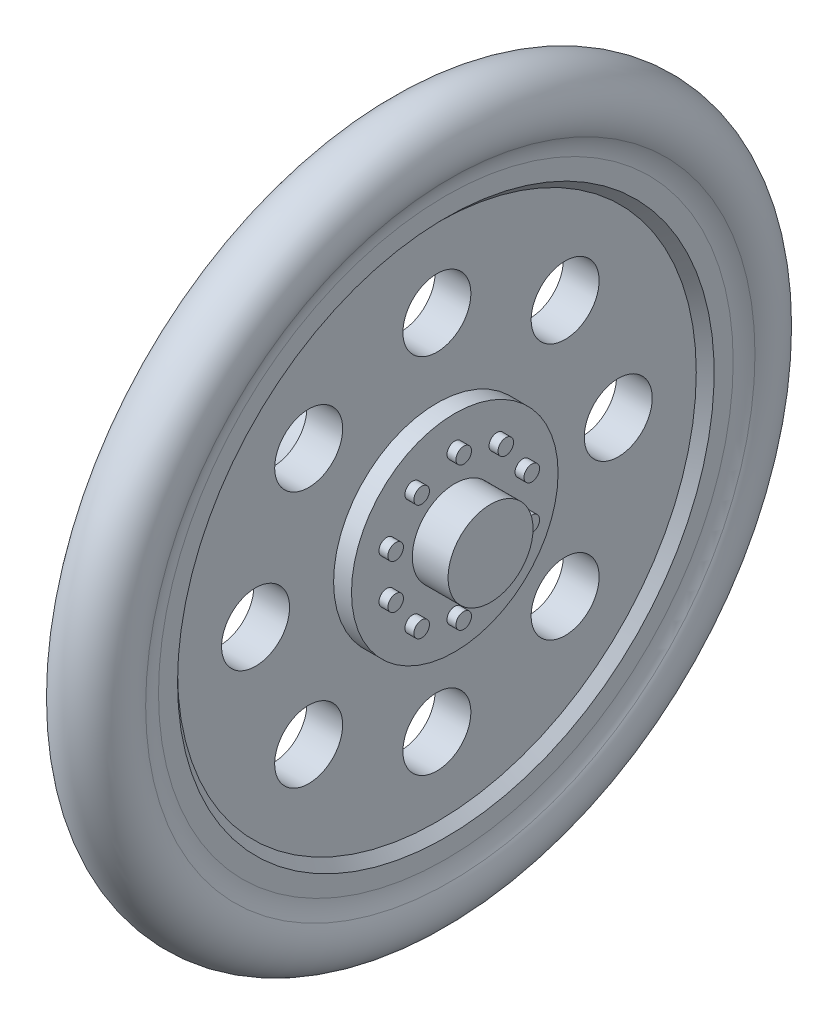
ISO-10303-21;
HEADER;
FILE_DESCRIPTION(('STEP AP214'),'2;1');
FILE_NAME('part.step','',(''),(''),'','','');
FILE_SCHEMA(('AUTOMOTIVE_DESIGN { 1 0 10303 214 1 1 1 1 }'));
ENDSEC;
DATA;
#1=APPLICATION_CONTEXT('core data for automotive mechanical design processes');
#2=APPLICATION_PROTOCOL_DEFINITION('international standard','automotive_design',2000,#1);
#3=PRODUCT_CONTEXT('',#1,'mechanical');
#4=PRODUCT('Part','Part','',(#3));
#5=PRODUCT_RELATED_PRODUCT_CATEGORY('part','',(#4));
#6=PRODUCT_DEFINITION_FORMATION('','',#4);
#7=PRODUCT_DEFINITION_CONTEXT('part definition',#1,'design');
#8=PRODUCT_DEFINITION('design','',#6,#7);
#9=PRODUCT_DEFINITION_SHAPE('','',#8);
#10=(LENGTH_UNIT() NAMED_UNIT(*) SI_UNIT(.MILLI.,.METRE.));
#11=(NAMED_UNIT(*) PLANE_ANGLE_UNIT() SI_UNIT($,.RADIAN.));
#12=(NAMED_UNIT(*) SI_UNIT($,.STERADIAN.) SOLID_ANGLE_UNIT());
#13=UNCERTAINTY_MEASURE_WITH_UNIT(LENGTH_MEASURE(1.E-05),#10,'distance_accuracy_value','');
#14=(GEOMETRIC_REPRESENTATION_CONTEXT(3) GLOBAL_UNCERTAINTY_ASSIGNED_CONTEXT((#13)) GLOBAL_UNIT_ASSIGNED_CONTEXT((#10,
#11,#12)) REPRESENTATION_CONTEXT('',''));
#15=CARTESIAN_POINT('',(0.,0.,0.));
#16=DIRECTION('',(0.,0.,1.));
#17=DIRECTION('',(1.,0.,0.));
#18=AXIS2_PLACEMENT_3D('',#15,#16,#17);
#19=CARTESIAN_POINT('',(10.5,0.,0.));
#20=DIRECTION('',(1.,0.,0.));
#21=DIRECTION('',(0.,0.,-1.));
#22=AXIS2_PLACEMENT_3D('',#19,#20,#21);
#23=PLANE('',#22);
#24=CARTESIAN_POINT('',(10.5,1.23606797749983,-3.8042260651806));
#25=DIRECTION('',(1.,0.,0.));
#26=DIRECTION('',(0.,-0.95105651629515,-0.309016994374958));
#27=AXIS2_PLACEMENT_3D('',#24,#25,#26);
#28=CIRCLE('',#27,0.435);
#29=CARTESIAN_POINT('',(10.5,0.822358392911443,-3.93864845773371));
#30=VERTEX_POINT('',#29);
#31=EDGE_CURVE('E102',#30,#30,#28,.T.);
#32=ORIENTED_EDGE('',*,*,#31,.F.);
#33=EDGE_LOOP('',(#32));
#34=FACE_BOUND('',#33,.T.);
#35=CARTESIAN_POINT('',(10.5,-3.23606797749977,-2.35114100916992));
#36=DIRECTION('',(1.,0.,0.));
#37=DIRECTION('',(0.,-0.58778525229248,0.809016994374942));
#38=AXIS2_PLACEMENT_3D('',#35,#36,#37);
#39=CIRCLE('',#38,0.435);
#40=CARTESIAN_POINT('',(10.5,-3.491754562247,-1.99921861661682));
#41=VERTEX_POINT('',#40);
#42=EDGE_CURVE('E114',#41,#41,#39,.T.);
#43=ORIENTED_EDGE('',*,*,#42,.F.);
#44=EDGE_LOOP('',(#43));
#45=FACE_BOUND('',#44,.T.);
#46=CARTESIAN_POINT('',(10.5,-3.2360679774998,2.35114100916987));
#47=DIRECTION('',(1.,0.,0.));
#48=DIRECTION('',(0.,0.587785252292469,0.809016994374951));
#49=AXIS2_PLACEMENT_3D('',#46,#47,#48);
#50=CIRCLE('',#49,0.435);
#51=CARTESIAN_POINT('',(10.5,-2.98038139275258,2.70306340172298));
#52=VERTEX_POINT('',#51);
#53=EDGE_CURVE('E126',#52,#52,#50,.T.);
#54=ORIENTED_EDGE('',*,*,#53,.F.);
#55=EDGE_LOOP('',(#54));
#56=FACE_BOUND('',#55,.T.);
#57=CARTESIAN_POINT('',(10.5,1.23606797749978,3.80422606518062));
#58=DIRECTION('',(1.,0.,0.));
#59=DIRECTION('',(0.,0.951056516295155,-0.309016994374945));
#60=AXIS2_PLACEMENT_3D('',#57,#58,#59);
#61=CIRCLE('',#60,0.435);
#62=CARTESIAN_POINT('',(10.5,1.64977756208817,3.66980367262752));
#63=VERTEX_POINT('',#62);
#64=EDGE_CURVE('E138',#63,#63,#61,.T.);
#65=ORIENTED_EDGE('',*,*,#64,.F.);
#66=EDGE_LOOP('',(#65));
#67=FACE_BOUND('',#66,.T.);
#68=CARTESIAN_POINT('',(10.5,4.,0.));
#69=DIRECTION('',(1.,0.,0.));
#70=DIRECTION('',(0.,0.,-1.));
#71=AXIS2_PLACEMENT_3D('',#68,#69,#70);
#72=CIRCLE('',#71,0.435);
#73=CARTESIAN_POINT('',(10.5,4.,-0.435));
#74=VERTEX_POINT('',#73);
#75=EDGE_CURVE('E150',#74,#74,#72,.T.);
#76=ORIENTED_EDGE('',*,*,#75,.F.);
#77=EDGE_LOOP('',(#76));
#78=FACE_BOUND('',#77,.T.);
#79=CARTESIAN_POINT('',(10.5,0.,0.));
#80=DIRECTION('',(1.,0.,0.));
#81=DIRECTION('',(0.,0.,-1.));
#82=AXIS2_PLACEMENT_3D('',#79,#80,#81);
#83=CIRCLE('',#82,5.775);
#84=CARTESIAN_POINT('',(10.5,0.,-5.775));
#85=VERTEX_POINT('',#84);
#86=EDGE_CURVE('E162',#85,#85,#83,.T.);
#87=ORIENTED_EDGE('',*,*,#86,.T.);
#88=EDGE_LOOP('',(#87));
#89=FACE_BOUND('',#88,.T.);
#90=CARTESIAN_POINT('',(10.5,0.,0.));
#91=DIRECTION('',(1.,0.,0.));
#92=DIRECTION('',(0.,0.,-1.));
#93=AXIS2_PLACEMENT_3D('',#90,#91,#92);
#94=CIRCLE('',#93,2.375);
#95=CARTESIAN_POINT('',(10.5,0.,-2.375));
#96=VERTEX_POINT('',#95);
#97=EDGE_CURVE('E156',#96,#96,#94,.T.);
#98=ORIENTED_EDGE('',*,*,#97,.F.);
#99=EDGE_LOOP('',(#98));
#100=FACE_BOUND('',#99,.T.);
#101=CARTESIAN_POINT('',(10.5,3.23606797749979,2.3511410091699));
#102=DIRECTION('',(1.,0.,0.));
#103=DIRECTION('',(0.,0.587785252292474,-0.809016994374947));
#104=AXIS2_PLACEMENT_3D('',#101,#102,#103);
#105=CIRCLE('',#104,0.435);
#106=CARTESIAN_POINT('',(10.5,3.49175456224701,1.9992186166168));
#107=VERTEX_POINT('',#106);
#108=EDGE_CURVE('E144',#107,#107,#105,.T.);
#109=ORIENTED_EDGE('',*,*,#108,.F.);
#110=EDGE_LOOP('',(#109));
#111=FACE_BOUND('',#110,.T.);
#112=CARTESIAN_POINT('',(10.5,-1.23606797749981,3.80422606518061));
#113=DIRECTION('',(1.,0.,0.));
#114=DIRECTION('',(0.,0.951056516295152,0.309016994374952));
#115=AXIS2_PLACEMENT_3D('',#112,#113,#114);
#116=CIRCLE('',#115,0.435);
#117=CARTESIAN_POINT('',(10.5,-0.822358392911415,3.93864845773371));
#118=VERTEX_POINT('',#117);
#119=EDGE_CURVE('E132',#118,#118,#116,.T.);
#120=ORIENTED_EDGE('',*,*,#119,.F.);
#121=EDGE_LOOP('',(#120));
#122=FACE_BOUND('',#121,.T.);
#123=CARTESIAN_POINT('',(10.5,-4.,0.));
#124=DIRECTION('',(1.,0.,0.));
#125=DIRECTION('',(0.,0.,1.));
#126=AXIS2_PLACEMENT_3D('',#123,#124,#125);
#127=CIRCLE('',#126,0.435);
#128=CARTESIAN_POINT('',(10.5,-4.,0.434999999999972));
#129=VERTEX_POINT('',#128);
#130=EDGE_CURVE('E120',#129,#129,#127,.T.);
#131=ORIENTED_EDGE('',*,*,#130,.F.);
#132=EDGE_LOOP('',(#131));
#133=FACE_BOUND('',#132,.T.);
#134=CARTESIAN_POINT('',(10.5,-1.23606797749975,-3.80422606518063));
#135=DIRECTION('',(1.,0.,0.));
#136=DIRECTION('',(0.,-0.951056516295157,0.309016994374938));
#137=AXIS2_PLACEMENT_3D('',#134,#135,#136);
#138=CIRCLE('',#137,0.435);
#139=CARTESIAN_POINT('',(10.5,-1.64977756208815,-3.66980367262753));
#140=VERTEX_POINT('',#139);
#141=EDGE_CURVE('E108',#140,#140,#138,.T.);
#142=ORIENTED_EDGE('',*,*,#141,.F.);
#143=EDGE_LOOP('',(#142));
#144=FACE_BOUND('',#143,.T.);
#145=CARTESIAN_POINT('',(10.5,3.23606797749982,-2.35114100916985));
#146=DIRECTION('',(1.,0.,0.));
#147=DIRECTION('',(0.,-0.587785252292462,-0.809016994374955));
#148=AXIS2_PLACEMENT_3D('',#145,#146,#147);
#149=CIRCLE('',#148,0.435);
#150=CARTESIAN_POINT('',(10.5,2.9803813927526,-2.70306340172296));
#151=VERTEX_POINT('',#150);
#152=EDGE_CURVE('E52',#151,#151,#149,.T.);
#153=ORIENTED_EDGE('',*,*,#152,.F.);
#154=EDGE_LOOP('',(#153));
#155=FACE_BOUND('',#154,.T.);
#156=ADVANCED_FACE('F32',(#34,#45,#56,#67,#78,#89,#100,#111,#122,#133,#144,#155),#23,.T.);
#157=CARTESIAN_POINT('',(9.5,14.5,0.));
#158=DIRECTION('',(-1.,0.,0.));
#159=DIRECTION('',(0.,0.,1.));
#160=AXIS2_PLACEMENT_3D('',#157,#158,#159);
#161=PLANE('',#160);
#162=CARTESIAN_POINT('',(9.5,7.16829499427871,-7.16829499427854));
#163=DIRECTION('',(1.,0.,0.));
#164=DIRECTION('',(0.,-0.707106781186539,-0.707106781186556));
#165=AXIS2_PLACEMENT_3D('',#162,#163,#164);
#166=CIRCLE('',#165,1.9);
#167=CARTESIAN_POINT('',(9.5,5.82479211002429,-8.511797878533));
#168=VERTEX_POINT('',#167);
#169=EDGE_CURVE('E85',#168,#168,#166,.T.);
#170=ORIENTED_EDGE('',*,*,#169,.F.);
#171=EDGE_LOOP('',(#170));
#172=FACE_BOUND('',#171,.T.);
#173=CARTESIAN_POINT('',(9.5,1.06184737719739E-13,-10.1375));
#174=DIRECTION('',(1.,0.,0.));
#175=DIRECTION('',(0.,-1.,0.));
#176=AXIS2_PLACEMENT_3D('',#173,#174,#175);
#177=CIRCLE('',#176,1.9);
#178=CARTESIAN_POINT('',(9.5,-1.8999999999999,-10.1375));
#179=VERTEX_POINT('',#178);
#180=EDGE_CURVE('E75',#179,#179,#177,.T.);
#181=ORIENTED_EDGE('',*,*,#180,.F.);
#182=EDGE_LOOP('',(#181));
#183=FACE_BOUND('',#182,.T.);
#184=CARTESIAN_POINT('',(9.5,-7.16829499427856,-7.16829499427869));
#185=DIRECTION('',(1.,0.,0.));
#186=DIRECTION('',(0.,-0.707106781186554,0.707106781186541));
#187=AXIS2_PLACEMENT_3D('',#184,#185,#186);
#188=CIRCLE('',#187,1.9);
#189=CARTESIAN_POINT('',(9.5,-8.51179787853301,-5.82479211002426));
#190=VERTEX_POINT('',#189);
#191=EDGE_CURVE('E72',#190,#190,#188,.T.);
#192=ORIENTED_EDGE('',*,*,#191,.F.);
#193=EDGE_LOOP('',(#192));
#194=FACE_BOUND('',#193,.T.);
#195=CARTESIAN_POINT('',(9.5,-10.1375,0.));
#196=DIRECTION('',(1.,0.,0.));
#197=DIRECTION('',(0.,0.,1.));
#198=AXIS2_PLACEMENT_3D('',#195,#196,#197);
#199=CIRCLE('',#198,1.9);
#200=CARTESIAN_POINT('',(9.5,-10.1375,1.89999999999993));
#201=VERTEX_POINT('',#200);
#202=EDGE_CURVE('E69',#201,#201,#199,.T.);
#203=ORIENTED_EDGE('',*,*,#202,.F.);
#204=EDGE_LOOP('',(#203));
#205=FACE_BOUND('',#204,.T.);
#206=CARTESIAN_POINT('',(9.5,-7.16829499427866,7.16829499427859));
#207=DIRECTION('',(1.,0.,0.));
#208=DIRECTION('',(0.,0.707106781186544,0.707106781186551));
#209=AXIS2_PLACEMENT_3D('',#206,#207,#208);
#210=CIRCLE('',#209,1.9);
#211=CARTESIAN_POINT('',(9.5,-5.82479211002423,8.51179787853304));
#212=VERTEX_POINT('',#211);
#213=EDGE_CURVE('E65',#212,#212,#210,.T.);
#214=ORIENTED_EDGE('',*,*,#213,.F.);
#215=EDGE_LOOP('',(#214));
#216=FACE_BOUND('',#215,.T.);
#217=CARTESIAN_POINT('',(9.5,0.,10.1375));
#218=DIRECTION('',(1.,0.,0.));
#219=DIRECTION('',(0.,1.,0.));
#220=AXIS2_PLACEMENT_3D('',#217,#218,#219);
#221=CIRCLE('',#220,1.9);
#222=CARTESIAN_POINT('',(9.5,1.89999999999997,10.1375));
#223=VERTEX_POINT('',#222);
#224=EDGE_CURVE('E61',#223,#223,#221,.T.);
#225=ORIENTED_EDGE('',*,*,#224,.F.);
#226=EDGE_LOOP('',(#225));
#227=FACE_BOUND('',#226,.T.);
#228=CARTESIAN_POINT('',(9.5,7.16829499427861,7.16829499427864));
#229=DIRECTION('',(1.,0.,0.));
#230=DIRECTION('',(0.,0.707106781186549,-0.707106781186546));
#231=AXIS2_PLACEMENT_3D('',#228,#229,#230);
#232=CIRCLE('',#231,1.9);
#233=CARTESIAN_POINT('',(9.5,8.51179787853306,5.8247921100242));
#234=VERTEX_POINT('',#233);
#235=EDGE_CURVE('E57',#234,#234,#232,.T.);
#236=ORIENTED_EDGE('',*,*,#235,.F.);
#237=EDGE_LOOP('',(#236));
#238=FACE_BOUND('',#237,.T.);
#239=CARTESIAN_POINT('',(9.5,10.1375,0.));
#240=DIRECTION('',(1.,0.,0.));
#241=DIRECTION('',(0.,0.,-1.));
#242=AXIS2_PLACEMENT_3D('',#239,#240,#241);
#243=CIRCLE('',#242,1.9);
#244=CARTESIAN_POINT('',(9.5,10.1375,-1.9));
#245=VERTEX_POINT('',#244);
#246=EDGE_CURVE('E53',#245,#245,#243,.T.);
#247=ORIENTED_EDGE('',*,*,#246,.F.);
#248=EDGE_LOOP('',(#247));
#249=FACE_BOUND('',#248,.T.);
#250=CARTESIAN_POINT('',(9.5,0.,0.));
#251=DIRECTION('',(-1.,0.,0.));
#252=DIRECTION('',(0.,0.,1.));
#253=AXIS2_PLACEMENT_3D('',#250,#251,#252);
#254=CIRCLE('',#253,14.5);
#255=CARTESIAN_POINT('',(9.5,0.,14.5));
#256=VERTEX_POINT('',#255);
#257=EDGE_CURVE('E182',#256,#256,#254,.T.);
#258=ORIENTED_EDGE('',*,*,#257,.F.);
#259=EDGE_LOOP('',(#258));
#260=FACE_BOUND('',#259,.T.);
#261=CARTESIAN_POINT('',(9.5,0.,0.));
#262=DIRECTION('',(-1.,0.,0.));
#263=DIRECTION('',(0.,0.,1.));
#264=AXIS2_PLACEMENT_3D('',#261,#262,#263);
#265=CIRCLE('',#264,5.775);
#266=CARTESIAN_POINT('',(9.5,0.,5.775));
#267=VERTEX_POINT('',#266);
#268=EDGE_CURVE('E11',#267,#267,#265,.F.);
#269=ORIENTED_EDGE('',*,*,#268,.F.);
#270=EDGE_LOOP('',(#269));
#271=FACE_BOUND('',#270,.T.);
#272=ADVANCED_FACE('F220',(#172,#183,#194,#205,#216,#227,#238,#249,#260,#271),#161,.F.);
#273=CARTESIAN_POINT('',(0.,0.,0.));
#274=DIRECTION('',(1.,0.,0.));
#275=DIRECTION('',(0.,0.,-1.));
#276=AXIS2_PLACEMENT_3D('',#273,#274,#275);
#277=PLANE('',#276);
#278=CARTESIAN_POINT('',(0.,0.,0.));
#279=DIRECTION('',(-1.,0.,0.));
#280=DIRECTION('',(0.,0.,1.));
#281=AXIS2_PLACEMENT_3D('',#278,#279,#280);
#282=CIRCLE('',#281,1.63);
#283=CARTESIAN_POINT('',(0.,0.,1.63));
#284=VERTEX_POINT('',#283);
#285=EDGE_CURVE('E638',#284,#284,#282,.T.);
#286=ORIENTED_EDGE('',*,*,#285,.F.);
#287=EDGE_LOOP('',(#286));
#288=FACE_BOUND('',#287,.T.);
#289=CARTESIAN_POINT('',(0.,0.,0.));
#290=DIRECTION('',(-1.,0.,0.));
#291=DIRECTION('',(0.,0.,1.));
#292=AXIS2_PLACEMENT_3D('',#289,#290,#291);
#293=CIRCLE('',#292,3.1);
#294=CARTESIAN_POINT('',(0.,0.,3.1));
#295=VERTEX_POINT('',#294);
#296=EDGE_CURVE('E167',#295,#295,#293,.T.);
#297=ORIENTED_EDGE('',*,*,#296,.T.);
#298=EDGE_LOOP('',(#297));
#299=FACE_BOUND('',#298,.T.);
#300=ADVANCED_FACE('F226',(#288,#299),#277,.F.);
#301=CARTESIAN_POINT('',(9.5,0.,0.));
#302=DIRECTION('',(1.,0.,0.));
#303=DIRECTION('',(0.,0.,-1.));
#304=AXIS2_PLACEMENT_3D('',#301,#302,#303);
#305=CONICAL_SURFACE('',#304,14.5,0.785398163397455);
#306=CARTESIAN_POINT('',(10.,0.,0.));
#307=DIRECTION('',(-1.,0.,0.));
#308=DIRECTION('',(0.,0.,1.));
#309=AXIS2_PLACEMENT_3D('',#306,#307,#308);
#310=CIRCLE('',#309,15.);
#311=CARTESIAN_POINT('',(10.,0.,15.));
#312=VERTEX_POINT('',#311);
#313=EDGE_CURVE('E179',#312,#312,#310,.T.);
#314=ORIENTED_EDGE('',*,*,#313,.F.);
#315=EDGE_LOOP('',(#314));
#316=FACE_BOUND('',#315,.T.);
#317=ORIENTED_EDGE('',*,*,#257,.T.);
#318=EDGE_LOOP('',(#317));
#319=FACE_BOUND('',#318,.T.);
#320=ADVANCED_FACE('F250',(#316,#319),#305,.F.);
#321=CARTESIAN_POINT('',(10.,16.6771243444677,0.));
#322=DIRECTION('',(-1.,0.,0.));
#323=DIRECTION('',(0.,0.,1.));
#324=AXIS2_PLACEMENT_3D('',#321,#322,#323);
#325=PLANE('',#324);
#326=CARTESIAN_POINT('',(10.,0.,0.));
#327=DIRECTION('',(-1.,0.,0.));
#328=DIRECTION('',(0.,0.,1.));
#329=AXIS2_PLACEMENT_3D('',#326,#327,#328);
#330=CIRCLE('',#329,16.0635083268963);
#331=CARTESIAN_POINT('',(10.,0.,16.0635083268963));
#332=VERTEX_POINT('',#331);
#333=EDGE_CURVE('E40',#332,#332,#330,.F.);
#334=ORIENTED_EDGE('',*,*,#333,.T.);
#335=EDGE_LOOP('',(#334));
#336=FACE_BOUND('',#335,.T.);
#337=ORIENTED_EDGE('',*,*,#313,.T.);
#338=EDGE_LOOP('',(#337));
#339=FACE_BOUND('',#338,.T.);
#340=ADVANCED_FACE('F256',(#336,#339),#325,.F.);
#341=CARTESIAN_POINT('',(8.5,0.,0.));
#342=DIRECTION('',(-1.,0.,0.));
#343=DIRECTION('',(0.,0.,1.));
#344=AXIS2_PLACEMENT_3D('',#341,#342,#343);
#345=TOROIDAL_SURFACE('',#344,18.,2.);
#346=CARTESIAN_POINT('',(6.75000000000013,0.,0.));
#347=DIRECTION('',(1.,0.,0.));
#348=DIRECTION('',(0.,0.,-1.));
#349=AXIS2_PLACEMENT_3D('',#346,#347,#348);
#350=CIRCLE('',#349,17.0317541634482);
#351=CARTESIAN_POINT('',(6.75000000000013,0.,-17.0317541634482));
#352=VERTEX_POINT('',#351);
#353=EDGE_CURVE('E45',#352,#352,#350,.T.);
#354=ORIENTED_EDGE('',*,*,#353,.T.);
#355=EDGE_LOOP('',(#354));
#356=FACE_BOUND('',#355,.T.);
#357=CARTESIAN_POINT('',(10.2499999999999,0.,0.));
#358=DIRECTION('',(-1.,0.,0.));
#359=DIRECTION('',(0.,0.,1.));
#360=AXIS2_PLACEMENT_3D('',#357,#358,#359);
#361=CIRCLE('',#360,17.0317541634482);
#362=CARTESIAN_POINT('',(10.2499999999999,0.,17.0317541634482));
#363=VERTEX_POINT('',#362);
#364=EDGE_CURVE('E188',#363,#363,#361,.T.);
#365=ORIENTED_EDGE('',*,*,#364,.T.);
#366=EDGE_LOOP('',(#365));
#367=FACE_BOUND('',#366,.T.);
#368=ADVANCED_FACE('F193',(#356,#367),#345,.T.);
#369=CARTESIAN_POINT('',(7.,16.6771243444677,0.));
#370=DIRECTION('',(1.,0.,0.));
#371=DIRECTION('',(0.,0.,-1.));
#372=AXIS2_PLACEMENT_3D('',#369,#370,#371);
#373=PLANE('',#372);
#374=CARTESIAN_POINT('',(7.,0.,0.));
#375=DIRECTION('',(1.,0.,0.));
#376=DIRECTION('',(0.,0.,-1.));
#377=AXIS2_PLACEMENT_3D('',#374,#375,#376);
#378=CIRCLE('',#377,16.0635083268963);
#379=CARTESIAN_POINT('',(7.,0.,-16.0635083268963));
#380=VERTEX_POINT('',#379);
#381=EDGE_CURVE('E185',#380,#380,#378,.F.);
#382=ORIENTED_EDGE('',*,*,#381,.T.);
#383=EDGE_LOOP('',(#382));
#384=FACE_BOUND('',#383,.T.);
#385=CARTESIAN_POINT('',(7.,0.,0.));
#386=DIRECTION('',(-1.,0.,0.));
#387=DIRECTION('',(0.,0.,1.));
#388=AXIS2_PLACEMENT_3D('',#385,#386,#387);
#389=CIRCLE('',#388,15.);
#390=CARTESIAN_POINT('',(7.,0.,15.));
#391=VERTEX_POINT('',#390);
#392=EDGE_CURVE('E176',#391,#391,#389,.T.);
#393=ORIENTED_EDGE('',*,*,#392,.F.);
#394=EDGE_LOOP('',(#393));
#395=FACE_BOUND('',#394,.T.);
#396=ADVANCED_FACE('F202',(#384,#395),#373,.F.);
#397=CARTESIAN_POINT('',(7.,0.,0.));
#398=DIRECTION('',(-1.,0.,0.));
#399=DIRECTION('',(0.,0.,1.));
#400=AXIS2_PLACEMENT_3D('',#397,#398,#399);
#401=CONICAL_SURFACE('',#400,15.,0.785398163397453);
#402=CARTESIAN_POINT('',(7.5,0.,0.));
#403=DIRECTION('',(-1.,0.,0.));
#404=DIRECTION('',(0.,0.,1.));
#405=AXIS2_PLACEMENT_3D('',#402,#403,#404);
#406=CIRCLE('',#405,14.5);
#407=CARTESIAN_POINT('',(7.5,0.,14.5));
#408=VERTEX_POINT('',#407);
#409=EDGE_CURVE('E173',#408,#408,#406,.T.);
#410=ORIENTED_EDGE('',*,*,#409,.F.);
#411=EDGE_LOOP('',(#410));
#412=FACE_BOUND('',#411,.T.);
#413=ORIENTED_EDGE('',*,*,#392,.T.);
#414=EDGE_LOOP('',(#413));
#415=FACE_BOUND('',#414,.T.);
#416=ADVANCED_FACE('F205',(#412,#415),#401,.F.);
#417=CARTESIAN_POINT('',(7.5,3.1,0.));
#418=DIRECTION('',(1.,0.,0.));
#419=DIRECTION('',(0.,0.,-1.));
#420=AXIS2_PLACEMENT_3D('',#417,#418,#419);
#421=PLANE('',#420);
#422=CARTESIAN_POINT('',(7.5,7.16829499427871,-7.16829499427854));
#423=DIRECTION('',(1.,0.,0.));
#424=DIRECTION('',(0.,0.,-1.));
#425=AXIS2_PLACEMENT_3D('',#422,#423,#424);
#426=CIRCLE('',#425,1.9);
#427=CARTESIAN_POINT('',(7.5,7.16829499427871,-9.06829499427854));
#428=VERTEX_POINT('',#427);
#429=EDGE_CURVE('E36',#428,#428,#426,.T.);
#430=ORIENTED_EDGE('',*,*,#429,.T.);
#431=EDGE_LOOP('',(#430));
#432=FACE_BOUND('',#431,.T.);
#433=CARTESIAN_POINT('',(7.5,1.06184737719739E-13,-10.1375));
#434=DIRECTION('',(1.,0.,0.));
#435=DIRECTION('',(0.,0.,-1.));
#436=AXIS2_PLACEMENT_3D('',#433,#434,#435);
#437=CIRCLE('',#436,1.9);
#438=CARTESIAN_POINT('',(7.5,1.06184737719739E-13,-12.0375));
#439=VERTEX_POINT('',#438);
#440=EDGE_CURVE('E73',#439,#439,#437,.T.);
#441=ORIENTED_EDGE('',*,*,#440,.T.);
#442=EDGE_LOOP('',(#441));
#443=FACE_BOUND('',#442,.T.);
#444=CARTESIAN_POINT('',(7.5,-7.16829499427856,-7.16829499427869));
#445=DIRECTION('',(1.,0.,0.));
#446=DIRECTION('',(0.,0.,-1.));
#447=AXIS2_PLACEMENT_3D('',#444,#445,#446);
#448=CIRCLE('',#447,1.9);
#449=CARTESIAN_POINT('',(7.5,-7.16829499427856,-9.06829499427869));
#450=VERTEX_POINT('',#449);
#451=EDGE_CURVE('E70',#450,#450,#448,.T.);
#452=ORIENTED_EDGE('',*,*,#451,.T.);
#453=EDGE_LOOP('',(#452));
#454=FACE_BOUND('',#453,.T.);
#455=CARTESIAN_POINT('',(7.5,-10.1375,0.));
#456=DIRECTION('',(1.,0.,0.));
#457=DIRECTION('',(0.,0.,-1.));
#458=AXIS2_PLACEMENT_3D('',#455,#456,#457);
#459=CIRCLE('',#458,1.9);
#460=CARTESIAN_POINT('',(7.5,-10.1375,-1.90000000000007));
#461=VERTEX_POINT('',#460);
#462=EDGE_CURVE('E66',#461,#461,#459,.T.);
#463=ORIENTED_EDGE('',*,*,#462,.T.);
#464=EDGE_LOOP('',(#463));
#465=FACE_BOUND('',#464,.T.);
#466=CARTESIAN_POINT('',(7.5,-7.16829499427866,7.16829499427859));
#467=DIRECTION('',(1.,0.,0.));
#468=DIRECTION('',(0.,0.,-1.));
#469=AXIS2_PLACEMENT_3D('',#466,#467,#468);
#470=CIRCLE('',#469,1.9);
#471=CARTESIAN_POINT('',(7.5,-7.16829499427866,5.26829499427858));
#472=VERTEX_POINT('',#471);
#473=EDGE_CURVE('E62',#472,#472,#470,.T.);
#474=ORIENTED_EDGE('',*,*,#473,.T.);
#475=EDGE_LOOP('',(#474));
#476=FACE_BOUND('',#475,.T.);
#477=CARTESIAN_POINT('',(7.5,0.,10.1375));
#478=DIRECTION('',(1.,0.,0.));
#479=DIRECTION('',(0.,0.,-1.));
#480=AXIS2_PLACEMENT_3D('',#477,#478,#479);
#481=CIRCLE('',#480,1.9);
#482=CARTESIAN_POINT('',(7.5,0.,8.2375));
#483=VERTEX_POINT('',#482);
#484=EDGE_CURVE('E58',#483,#483,#481,.T.);
#485=ORIENTED_EDGE('',*,*,#484,.T.);
#486=EDGE_LOOP('',(#485));
#487=FACE_BOUND('',#486,.T.);
#488=CARTESIAN_POINT('',(7.5,7.16829499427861,7.16829499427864));
#489=DIRECTION('',(1.,0.,0.));
#490=DIRECTION('',(0.,0.,-1.));
#491=AXIS2_PLACEMENT_3D('',#488,#489,#490);
#492=CIRCLE('',#491,1.9);
#493=CARTESIAN_POINT('',(7.5,7.16829499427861,5.26829499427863));
#494=VERTEX_POINT('',#493);
#495=EDGE_CURVE('E54',#494,#494,#492,.T.);
#496=ORIENTED_EDGE('',*,*,#495,.T.);
#497=EDGE_LOOP('',(#496));
#498=FACE_BOUND('',#497,.T.);
#499=CARTESIAN_POINT('',(7.5,10.1375,0.));
#500=DIRECTION('',(1.,0.,0.));
#501=DIRECTION('',(0.,0.,-1.));
#502=AXIS2_PLACEMENT_3D('',#499,#500,#501);
#503=CIRCLE('',#502,1.9);
#504=CARTESIAN_POINT('',(7.5,10.1375,-1.9));
#505=VERTEX_POINT('',#504);
#506=EDGE_CURVE('E49',#505,#505,#503,.T.);
#507=ORIENTED_EDGE('',*,*,#506,.T.);
#508=EDGE_LOOP('',(#507));
#509=FACE_BOUND('',#508,.T.);
#510=CARTESIAN_POINT('',(7.5,0.,0.));
#511=DIRECTION('',(-1.,0.,0.));
#512=DIRECTION('',(0.,0.,1.));
#513=AXIS2_PLACEMENT_3D('',#510,#511,#512);
#514=CIRCLE('',#513,3.1);
#515=CARTESIAN_POINT('',(7.5,0.,3.1));
#516=VERTEX_POINT('',#515);
#517=EDGE_CURVE('E170',#516,#516,#514,.T.);
#518=ORIENTED_EDGE('',*,*,#517,.F.);
#519=EDGE_LOOP('',(#518));
#520=FACE_BOUND('',#519,.T.);
#521=ORIENTED_EDGE('',*,*,#409,.T.);
#522=EDGE_LOOP('',(#521));
#523=FACE_BOUND('',#522,.T.);
#524=ADVANCED_FACE('F210',(#432,#443,#454,#465,#476,#487,#498,#509,#520,#523),#421,.F.);
#525=CARTESIAN_POINT('',(0.,0.,0.));
#526=DIRECTION('',(-1.,0.,0.));
#527=DIRECTION('',(0.,0.,1.));
#528=AXIS2_PLACEMENT_3D('',#525,#526,#527);
#529=CYLINDRICAL_SURFACE('',#528,3.1);
#530=ORIENTED_EDGE('',*,*,#296,.F.);
#531=EDGE_LOOP('',(#530));
#532=FACE_BOUND('',#531,.T.);
#533=ORIENTED_EDGE('',*,*,#517,.T.);
#534=EDGE_LOOP('',(#533));
#535=FACE_BOUND('',#534,.T.);
#536=ADVANCED_FACE('F199',(#532,#535),#529,.T.);
#537=CARTESIAN_POINT('',(5.,0.,0.));
#538=DIRECTION('',(-1.,0.,0.));
#539=DIRECTION('',(0.,0.,1.));
#540=AXIS2_PLACEMENT_3D('',#537,#538,#539);
#541=TOROIDAL_SURFACE('',#540,16.0635083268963,2.);
#542=ORIENTED_EDGE('',*,*,#353,.F.);
#543=EDGE_LOOP('',(#542));
#544=FACE_BOUND('',#543,.T.);
#545=ORIENTED_EDGE('',*,*,#381,.F.);
#546=EDGE_LOOP('',(#545));
#547=FACE_BOUND('',#546,.T.);
#548=ADVANCED_FACE('F196',(#544,#547),#541,.F.);
#549=CARTESIAN_POINT('',(12.,0.,0.));
#550=DIRECTION('',(1.,0.,0.));
#551=DIRECTION('',(0.,0.,-1.));
#552=AXIS2_PLACEMENT_3D('',#549,#550,#551);
#553=TOROIDAL_SURFACE('',#552,16.0635083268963,2.);
#554=ORIENTED_EDGE('',*,*,#333,.F.);
#555=EDGE_LOOP('',(#554));
#556=FACE_BOUND('',#555,.T.);
#557=ORIENTED_EDGE('',*,*,#364,.F.);
#558=EDGE_LOOP('',(#557));
#559=FACE_BOUND('',#558,.T.);
#560=ADVANCED_FACE('F34',(#556,#559),#553,.F.);
#561=CARTESIAN_POINT('',(10.5,0.,0.));
#562=DIRECTION('',(-1.,0.,0.));
#563=DIRECTION('',(0.,0.,1.));
#564=AXIS2_PLACEMENT_3D('',#561,#562,#563);
#565=CYLINDRICAL_SURFACE('',#564,5.775);
#566=ORIENTED_EDGE('',*,*,#86,.F.);
#567=EDGE_LOOP('',(#566));
#568=FACE_BOUND('',#567,.T.);
#569=ORIENTED_EDGE('',*,*,#268,.T.);
#570=EDGE_LOOP('',(#569));
#571=FACE_BOUND('',#570,.T.);
#572=ADVANCED_FACE('F235',(#568,#571),#565,.T.);
#573=CARTESIAN_POINT('',(12.5,0.,0.));
#574=DIRECTION('',(-1.,0.,0.));
#575=DIRECTION('',(0.,0.,1.));
#576=AXIS2_PLACEMENT_3D('',#573,#574,#575);
#577=CYLINDRICAL_SURFACE('',#576,2.375);
#578=CARTESIAN_POINT('',(12.5,0.,0.));
#579=DIRECTION('',(1.,0.,0.));
#580=DIRECTION('',(0.,0.,-1.));
#581=AXIS2_PLACEMENT_3D('',#578,#579,#580);
#582=CIRCLE('',#581,2.375);
#583=CARTESIAN_POINT('',(12.5,0.,-2.375));
#584=VERTEX_POINT('',#583);
#585=EDGE_CURVE('E159',#584,#584,#582,.T.);
#586=ORIENTED_EDGE('',*,*,#585,.F.);
#587=EDGE_LOOP('',(#586));
#588=FACE_BOUND('',#587,.T.);
#589=ORIENTED_EDGE('',*,*,#97,.T.);
#590=EDGE_LOOP('',(#589));
#591=FACE_BOUND('',#590,.T.);
#592=ADVANCED_FACE('F233',(#588,#591),#577,.T.);
#593=CARTESIAN_POINT('',(12.5,0.,0.));
#594=DIRECTION('',(1.,0.,0.));
#595=DIRECTION('',(0.,0.,-1.));
#596=AXIS2_PLACEMENT_3D('',#593,#594,#595);
#597=PLANE('',#596);
#598=ORIENTED_EDGE('',*,*,#585,.T.);
#599=EDGE_LOOP('',(#598));
#600=FACE_BOUND('',#599,.T.);
#601=ADVANCED_FACE('F305',(#600),#597,.T.);
#602=CARTESIAN_POINT('',(11.,4.,0.));
#603=DIRECTION('',(-1.,0.,0.));
#604=DIRECTION('',(0.,0.,1.));
#605=AXIS2_PLACEMENT_3D('',#602,#603,#604);
#606=CYLINDRICAL_SURFACE('',#605,0.435);
#607=CARTESIAN_POINT('',(11.,4.,0.));
#608=DIRECTION('',(1.,0.,0.));
#609=DIRECTION('',(0.,0.,-1.));
#610=AXIS2_PLACEMENT_3D('',#607,#608,#609);
#611=CIRCLE('',#610,0.435);
#612=CARTESIAN_POINT('',(11.,4.,-0.435));
#613=VERTEX_POINT('',#612);
#614=EDGE_CURVE('E153',#613,#613,#611,.T.);
#615=ORIENTED_EDGE('',*,*,#614,.F.);
#616=EDGE_LOOP('',(#615));
#617=FACE_BOUND('',#616,.T.);
#618=ORIENTED_EDGE('',*,*,#75,.T.);
#619=EDGE_LOOP('',(#618));
#620=FACE_BOUND('',#619,.T.);
#621=ADVANCED_FACE('F314',(#617,#620),#606,.T.);
#622=CARTESIAN_POINT('',(11.,4.,0.));
#623=DIRECTION('',(1.,0.,0.));
#624=DIRECTION('',(0.,0.,-1.));
#625=AXIS2_PLACEMENT_3D('',#622,#623,#624);
#626=PLANE('',#625);
#627=ORIENTED_EDGE('',*,*,#614,.T.);
#628=EDGE_LOOP('',(#627));
#629=FACE_BOUND('',#628,.T.);
#630=ADVANCED_FACE('F323',(#629),#626,.T.);
#631=CARTESIAN_POINT('',(11.,3.23606797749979,2.3511410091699));
#632=DIRECTION('',(-1.,0.,0.));
#633=DIRECTION('',(0.,0.,1.));
#634=AXIS2_PLACEMENT_3D('',#631,#632,#633);
#635=CYLINDRICAL_SURFACE('',#634,0.435);
#636=CARTESIAN_POINT('',(11.,3.23606797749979,2.3511410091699));
#637=DIRECTION('',(1.,0.,0.));
#638=DIRECTION('',(0.,0.587785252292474,-0.809016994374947));
#639=AXIS2_PLACEMENT_3D('',#636,#637,#638);
#640=CIRCLE('',#639,0.435);
#641=CARTESIAN_POINT('',(11.,3.49175456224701,1.9992186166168));
#642=VERTEX_POINT('',#641);
#643=EDGE_CURVE('E147',#642,#642,#640,.T.);
#644=ORIENTED_EDGE('',*,*,#643,.F.);
#645=EDGE_LOOP('',(#644));
#646=FACE_BOUND('',#645,.T.);
#647=ORIENTED_EDGE('',*,*,#108,.T.);
#648=EDGE_LOOP('',(#647));
#649=FACE_BOUND('',#648,.T.);
#650=ADVANCED_FACE('F332',(#646,#649),#635,.T.);
#651=CARTESIAN_POINT('',(11.,3.23606797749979,2.3511410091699));
#652=DIRECTION('',(1.,0.,0.));
#653=DIRECTION('',(0.,0.587785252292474,-0.809016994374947));
#654=AXIS2_PLACEMENT_3D('',#651,#652,#653);
#655=PLANE('',#654);
#656=ORIENTED_EDGE('',*,*,#643,.T.);
#657=EDGE_LOOP('',(#656));
#658=FACE_BOUND('',#657,.T.);
#659=ADVANCED_FACE('F347',(#658),#655,.T.);
#660=CARTESIAN_POINT('',(11.,1.23606797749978,3.80422606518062));
#661=DIRECTION('',(-1.,0.,0.));
#662=DIRECTION('',(0.,0.,1.));
#663=AXIS2_PLACEMENT_3D('',#660,#661,#662);
#664=CYLINDRICAL_SURFACE('',#663,0.435);
#665=CARTESIAN_POINT('',(11.,1.23606797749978,3.80422606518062));
#666=DIRECTION('',(1.,0.,0.));
#667=DIRECTION('',(0.,0.951056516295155,-0.309016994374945));
#668=AXIS2_PLACEMENT_3D('',#665,#666,#667);
#669=CIRCLE('',#668,0.435);
#670=CARTESIAN_POINT('',(11.,1.64977756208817,3.66980367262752));
#671=VERTEX_POINT('',#670);
#672=EDGE_CURVE('E141',#671,#671,#669,.T.);
#673=ORIENTED_EDGE('',*,*,#672,.F.);
#674=EDGE_LOOP('',(#673));
#675=FACE_BOUND('',#674,.T.);
#676=ORIENTED_EDGE('',*,*,#64,.T.);
#677=EDGE_LOOP('',(#676));
#678=FACE_BOUND('',#677,.T.);
#679=ADVANCED_FACE('F357',(#675,#678),#664,.T.);
#680=CARTESIAN_POINT('',(11.,1.23606797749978,3.80422606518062));
#681=DIRECTION('',(1.,0.,0.));
#682=DIRECTION('',(0.,0.951056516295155,-0.309016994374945));
#683=AXIS2_PLACEMENT_3D('',#680,#681,#682);
#684=PLANE('',#683);
#685=ORIENTED_EDGE('',*,*,#672,.T.);
#686=EDGE_LOOP('',(#685));
#687=FACE_BOUND('',#686,.T.);
#688=ADVANCED_FACE('F367',(#687),#684,.T.);
#689=CARTESIAN_POINT('',(11.,-1.23606797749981,3.80422606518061));
#690=DIRECTION('',(-1.,0.,0.));
#691=DIRECTION('',(0.,0.,1.));
#692=AXIS2_PLACEMENT_3D('',#689,#690,#691);
#693=CYLINDRICAL_SURFACE('',#692,0.435);
#694=CARTESIAN_POINT('',(11.,-1.23606797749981,3.80422606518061));
#695=DIRECTION('',(1.,0.,0.));
#696=DIRECTION('',(0.,0.951056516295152,0.309016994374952));
#697=AXIS2_PLACEMENT_3D('',#694,#695,#696);
#698=CIRCLE('',#697,0.435);
#699=CARTESIAN_POINT('',(11.,-0.822358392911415,3.93864845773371));
#700=VERTEX_POINT('',#699);
#701=EDGE_CURVE('E135',#700,#700,#698,.T.);
#702=ORIENTED_EDGE('',*,*,#701,.F.);
#703=EDGE_LOOP('',(#702));
#704=FACE_BOUND('',#703,.T.);
#705=ORIENTED_EDGE('',*,*,#119,.T.);
#706=EDGE_LOOP('',(#705));
#707=FACE_BOUND('',#706,.T.);
#708=ADVANCED_FACE('F377',(#704,#707),#693,.T.);
#709=CARTESIAN_POINT('',(11.,-1.23606797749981,3.80422606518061));
#710=DIRECTION('',(1.,0.,0.));
#711=DIRECTION('',(0.,0.951056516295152,0.309016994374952));
#712=AXIS2_PLACEMENT_3D('',#709,#710,#711);
#713=PLANE('',#712);
#714=ORIENTED_EDGE('',*,*,#701,.T.);
#715=EDGE_LOOP('',(#714));
#716=FACE_BOUND('',#715,.T.);
#717=ADVANCED_FACE('F387',(#716),#713,.T.);
#718=CARTESIAN_POINT('',(11.,-3.2360679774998,2.35114100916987));
#719=DIRECTION('',(-1.,0.,0.));
#720=DIRECTION('',(0.,0.,1.));
#721=AXIS2_PLACEMENT_3D('',#718,#719,#720);
#722=CYLINDRICAL_SURFACE('',#721,0.435);
#723=CARTESIAN_POINT('',(11.,-3.2360679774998,2.35114100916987));
#724=DIRECTION('',(1.,0.,0.));
#725=DIRECTION('',(0.,0.587785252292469,0.809016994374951));
#726=AXIS2_PLACEMENT_3D('',#723,#724,#725);
#727=CIRCLE('',#726,0.435);
#728=CARTESIAN_POINT('',(11.,-2.98038139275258,2.70306340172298));
#729=VERTEX_POINT('',#728);
#730=EDGE_CURVE('E129',#729,#729,#727,.T.);
#731=ORIENTED_EDGE('',*,*,#730,.F.);
#732=EDGE_LOOP('',(#731));
#733=FACE_BOUND('',#732,.T.);
#734=ORIENTED_EDGE('',*,*,#53,.T.);
#735=EDGE_LOOP('',(#734));
#736=FACE_BOUND('',#735,.T.);
#737=ADVANCED_FACE('F397',(#733,#736),#722,.T.);
#738=CARTESIAN_POINT('',(11.,-3.2360679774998,2.35114100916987));
#739=DIRECTION('',(1.,0.,0.));
#740=DIRECTION('',(0.,0.587785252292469,0.809016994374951));
#741=AXIS2_PLACEMENT_3D('',#738,#739,#740);
#742=PLANE('',#741);
#743=ORIENTED_EDGE('',*,*,#730,.T.);
#744=EDGE_LOOP('',(#743));
#745=FACE_BOUND('',#744,.T.);
#746=ADVANCED_FACE('F407',(#745),#742,.T.);
#747=CARTESIAN_POINT('',(11.,-4.,0.));
#748=DIRECTION('',(-1.,0.,0.));
#749=DIRECTION('',(0.,0.,1.));
#750=AXIS2_PLACEMENT_3D('',#747,#748,#749);
#751=CYLINDRICAL_SURFACE('',#750,0.435);
#752=CARTESIAN_POINT('',(11.,-4.,0.));
#753=DIRECTION('',(1.,0.,0.));
#754=DIRECTION('',(0.,0.,1.));
#755=AXIS2_PLACEMENT_3D('',#752,#753,#754);
#756=CIRCLE('',#755,0.435);
#757=CARTESIAN_POINT('',(11.,-4.,0.434999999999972));
#758=VERTEX_POINT('',#757);
#759=EDGE_CURVE('E123',#758,#758,#756,.T.);
#760=ORIENTED_EDGE('',*,*,#759,.F.);
#761=EDGE_LOOP('',(#760));
#762=FACE_BOUND('',#761,.T.);
#763=ORIENTED_EDGE('',*,*,#130,.T.);
#764=EDGE_LOOP('',(#763));
#765=FACE_BOUND('',#764,.T.);
#766=ADVANCED_FACE('F417',(#762,#765),#751,.T.);
#767=CARTESIAN_POINT('',(11.,-4.,0.));
#768=DIRECTION('',(1.,0.,0.));
#769=DIRECTION('',(0.,0.,1.));
#770=AXIS2_PLACEMENT_3D('',#767,#768,#769);
#771=PLANE('',#770);
#772=ORIENTED_EDGE('',*,*,#759,.T.);
#773=EDGE_LOOP('',(#772));
#774=FACE_BOUND('',#773,.T.);
#775=ADVANCED_FACE('F427',(#774),#771,.T.);
#776=CARTESIAN_POINT('',(11.,-3.23606797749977,-2.35114100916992));
#777=DIRECTION('',(-1.,0.,0.));
#778=DIRECTION('',(0.,0.,1.));
#779=AXIS2_PLACEMENT_3D('',#776,#777,#778);
#780=CYLINDRICAL_SURFACE('',#779,0.435);
#781=CARTESIAN_POINT('',(11.,-3.23606797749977,-2.35114100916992));
#782=DIRECTION('',(1.,0.,0.));
#783=DIRECTION('',(0.,-0.58778525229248,0.809016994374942));
#784=AXIS2_PLACEMENT_3D('',#781,#782,#783);
#785=CIRCLE('',#784,0.435);
#786=CARTESIAN_POINT('',(11.,-3.491754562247,-1.99921861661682));
#787=VERTEX_POINT('',#786);
#788=EDGE_CURVE('E117',#787,#787,#785,.T.);
#789=ORIENTED_EDGE('',*,*,#788,.F.);
#790=EDGE_LOOP('',(#789));
#791=FACE_BOUND('',#790,.T.);
#792=ORIENTED_EDGE('',*,*,#42,.T.);
#793=EDGE_LOOP('',(#792));
#794=FACE_BOUND('',#793,.T.);
#795=ADVANCED_FACE('F437',(#791,#794),#780,.T.);
#796=CARTESIAN_POINT('',(11.,-3.23606797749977,-2.35114100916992));
#797=DIRECTION('',(1.,0.,0.));
#798=DIRECTION('',(0.,-0.58778525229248,0.809016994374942));
#799=AXIS2_PLACEMENT_3D('',#796,#797,#798);
#800=PLANE('',#799);
#801=ORIENTED_EDGE('',*,*,#788,.T.);
#802=EDGE_LOOP('',(#801));
#803=FACE_BOUND('',#802,.T.);
#804=ADVANCED_FACE('F447',(#803),#800,.T.);
#805=CARTESIAN_POINT('',(11.,-1.23606797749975,-3.80422606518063));
#806=DIRECTION('',(-1.,0.,0.));
#807=DIRECTION('',(0.,0.,1.));
#808=AXIS2_PLACEMENT_3D('',#805,#806,#807);
#809=CYLINDRICAL_SURFACE('',#808,0.435);
#810=CARTESIAN_POINT('',(11.,-1.23606797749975,-3.80422606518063));
#811=DIRECTION('',(1.,0.,0.));
#812=DIRECTION('',(0.,-0.951056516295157,0.309016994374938));
#813=AXIS2_PLACEMENT_3D('',#810,#811,#812);
#814=CIRCLE('',#813,0.435);
#815=CARTESIAN_POINT('',(11.,-1.64977756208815,-3.66980367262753));
#816=VERTEX_POINT('',#815);
#817=EDGE_CURVE('E111',#816,#816,#814,.T.);
#818=ORIENTED_EDGE('',*,*,#817,.F.);
#819=EDGE_LOOP('',(#818));
#820=FACE_BOUND('',#819,.T.);
#821=ORIENTED_EDGE('',*,*,#141,.T.);
#822=EDGE_LOOP('',(#821));
#823=FACE_BOUND('',#822,.T.);
#824=ADVANCED_FACE('F457',(#820,#823),#809,.T.);
#825=CARTESIAN_POINT('',(11.,-1.23606797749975,-3.80422606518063));
#826=DIRECTION('',(1.,0.,0.));
#827=DIRECTION('',(0.,-0.951056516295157,0.309016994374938));
#828=AXIS2_PLACEMENT_3D('',#825,#826,#827);
#829=PLANE('',#828);
#830=ORIENTED_EDGE('',*,*,#817,.T.);
#831=EDGE_LOOP('',(#830));
#832=FACE_BOUND('',#831,.T.);
#833=ADVANCED_FACE('F467',(#832),#829,.T.);
#834=CARTESIAN_POINT('',(11.,1.23606797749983,-3.8042260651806));
#835=DIRECTION('',(-1.,0.,0.));
#836=DIRECTION('',(0.,0.,1.));
#837=AXIS2_PLACEMENT_3D('',#834,#835,#836);
#838=CYLINDRICAL_SURFACE('',#837,0.435);
#839=CARTESIAN_POINT('',(11.,1.23606797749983,-3.8042260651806));
#840=DIRECTION('',(1.,0.,0.));
#841=DIRECTION('',(0.,-0.95105651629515,-0.309016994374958));
#842=AXIS2_PLACEMENT_3D('',#839,#840,#841);
#843=CIRCLE('',#842,0.435);
#844=CARTESIAN_POINT('',(11.,0.822358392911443,-3.93864845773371));
#845=VERTEX_POINT('',#844);
#846=EDGE_CURVE('E105',#845,#845,#843,.T.);
#847=ORIENTED_EDGE('',*,*,#846,.F.);
#848=EDGE_LOOP('',(#847));
#849=FACE_BOUND('',#848,.T.);
#850=ORIENTED_EDGE('',*,*,#31,.T.);
#851=EDGE_LOOP('',(#850));
#852=FACE_BOUND('',#851,.T.);
#853=ADVANCED_FACE('F477',(#849,#852),#838,.T.);
#854=CARTESIAN_POINT('',(11.,1.23606797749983,-3.8042260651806));
#855=DIRECTION('',(1.,0.,0.));
#856=DIRECTION('',(0.,-0.95105651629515,-0.309016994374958));
#857=AXIS2_PLACEMENT_3D('',#854,#855,#856);
#858=PLANE('',#857);
#859=ORIENTED_EDGE('',*,*,#846,.T.);
#860=EDGE_LOOP('',(#859));
#861=FACE_BOUND('',#860,.T.);
#862=ADVANCED_FACE('F487',(#861),#858,.T.);
#863=CARTESIAN_POINT('',(11.,3.23606797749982,-2.35114100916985));
#864=DIRECTION('',(-1.,0.,0.));
#865=DIRECTION('',(0.,0.,1.));
#866=AXIS2_PLACEMENT_3D('',#863,#864,#865);
#867=CYLINDRICAL_SURFACE('',#866,0.435);
#868=CARTESIAN_POINT('',(11.,3.23606797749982,-2.35114100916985));
#869=DIRECTION('',(1.,0.,0.));
#870=DIRECTION('',(0.,-0.587785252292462,-0.809016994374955));
#871=AXIS2_PLACEMENT_3D('',#868,#869,#870);
#872=CIRCLE('',#871,0.435);
#873=CARTESIAN_POINT('',(11.,2.9803813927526,-2.70306340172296));
#874=VERTEX_POINT('',#873);
#875=EDGE_CURVE('E99',#874,#874,#872,.T.);
#876=ORIENTED_EDGE('',*,*,#875,.F.);
#877=EDGE_LOOP('',(#876));
#878=FACE_BOUND('',#877,.T.);
#879=ORIENTED_EDGE('',*,*,#152,.T.);
#880=EDGE_LOOP('',(#879));
#881=FACE_BOUND('',#880,.T.);
#882=ADVANCED_FACE('F497',(#878,#881),#867,.T.);
#883=CARTESIAN_POINT('',(11.,3.23606797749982,-2.35114100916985));
#884=DIRECTION('',(1.,0.,0.));
#885=DIRECTION('',(0.,-0.587785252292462,-0.809016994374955));
#886=AXIS2_PLACEMENT_3D('',#883,#884,#885);
#887=PLANE('',#886);
#888=ORIENTED_EDGE('',*,*,#875,.T.);
#889=EDGE_LOOP('',(#888));
#890=FACE_BOUND('',#889,.T.);
#891=ADVANCED_FACE('F507',(#890),#887,.T.);
#892=CARTESIAN_POINT('',(0.,10.1375,0.));
#893=DIRECTION('',(1.,0.,0.));
#894=DIRECTION('',(0.,0.,-1.));
#895=AXIS2_PLACEMENT_3D('',#892,#893,#894);
#896=CYLINDRICAL_SURFACE('',#895,1.9);
#897=ORIENTED_EDGE('',*,*,#246,.T.);
#898=EDGE_LOOP('',(#897));
#899=FACE_BOUND('',#898,.T.);
#900=ORIENTED_EDGE('',*,*,#506,.F.);
#901=EDGE_LOOP('',(#900));
#902=FACE_BOUND('',#901,.T.);
#903=ADVANCED_FACE('F517',(#899,#902),#896,.F.);
#904=CARTESIAN_POINT('',(0.,7.16829499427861,7.16829499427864));
#905=DIRECTION('',(1.,0.,0.));
#906=DIRECTION('',(0.,0.,-1.));
#907=AXIS2_PLACEMENT_3D('',#904,#905,#906);
#908=CYLINDRICAL_SURFACE('',#907,1.9);
#909=ORIENTED_EDGE('',*,*,#235,.T.);
#910=EDGE_LOOP('',(#909));
#911=FACE_BOUND('',#910,.T.);
#912=ORIENTED_EDGE('',*,*,#495,.F.);
#913=EDGE_LOOP('',(#912));
#914=FACE_BOUND('',#913,.T.);
#915=ADVANCED_FACE('F527',(#911,#914),#908,.F.);
#916=CARTESIAN_POINT('',(0.,0.,10.1375));
#917=DIRECTION('',(1.,0.,0.));
#918=DIRECTION('',(0.,0.,-1.));
#919=AXIS2_PLACEMENT_3D('',#916,#917,#918);
#920=CYLINDRICAL_SURFACE('',#919,1.9);
#921=ORIENTED_EDGE('',*,*,#224,.T.);
#922=EDGE_LOOP('',(#921));
#923=FACE_BOUND('',#922,.T.);
#924=ORIENTED_EDGE('',*,*,#484,.F.);
#925=EDGE_LOOP('',(#924));
#926=FACE_BOUND('',#925,.T.);
#927=ADVANCED_FACE('F548',(#923,#926),#920,.F.);
#928=CARTESIAN_POINT('',(0.,-7.16829499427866,7.16829499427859));
#929=DIRECTION('',(1.,0.,0.));
#930=DIRECTION('',(0.,0.,-1.));
#931=AXIS2_PLACEMENT_3D('',#928,#929,#930);
#932=CYLINDRICAL_SURFACE('',#931,1.9);
#933=ORIENTED_EDGE('',*,*,#213,.T.);
#934=EDGE_LOOP('',(#933));
#935=FACE_BOUND('',#934,.T.);
#936=ORIENTED_EDGE('',*,*,#473,.F.);
#937=EDGE_LOOP('',(#936));
#938=FACE_BOUND('',#937,.T.);
#939=ADVANCED_FACE('F558',(#935,#938),#932,.F.);
#940=CARTESIAN_POINT('',(0.,-10.1375,0.));
#941=DIRECTION('',(1.,0.,0.));
#942=DIRECTION('',(0.,0.,-1.));
#943=AXIS2_PLACEMENT_3D('',#940,#941,#942);
#944=CYLINDRICAL_SURFACE('',#943,1.9);
#945=ORIENTED_EDGE('',*,*,#202,.T.);
#946=EDGE_LOOP('',(#945));
#947=FACE_BOUND('',#946,.T.);
#948=ORIENTED_EDGE('',*,*,#462,.F.);
#949=EDGE_LOOP('',(#948));
#950=FACE_BOUND('',#949,.T.);
#951=ADVANCED_FACE('F568',(#947,#950),#944,.F.);
#952=CARTESIAN_POINT('',(0.,-7.16829499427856,-7.16829499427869));
#953=DIRECTION('',(1.,0.,0.));
#954=DIRECTION('',(0.,0.,-1.));
#955=AXIS2_PLACEMENT_3D('',#952,#953,#954);
#956=CYLINDRICAL_SURFACE('',#955,1.9);
#957=ORIENTED_EDGE('',*,*,#191,.T.);
#958=EDGE_LOOP('',(#957));
#959=FACE_BOUND('',#958,.T.);
#960=ORIENTED_EDGE('',*,*,#451,.F.);
#961=EDGE_LOOP('',(#960));
#962=FACE_BOUND('',#961,.T.);
#963=ADVANCED_FACE('F578',(#959,#962),#956,.F.);
#964=CARTESIAN_POINT('',(0.,1.06184737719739E-13,-10.1375));
#965=DIRECTION('',(1.,0.,0.));
#966=DIRECTION('',(0.,0.,-1.));
#967=AXIS2_PLACEMENT_3D('',#964,#965,#966);
#968=CYLINDRICAL_SURFACE('',#967,1.9);
#969=ORIENTED_EDGE('',*,*,#180,.T.);
#970=EDGE_LOOP('',(#969));
#971=FACE_BOUND('',#970,.T.);
#972=ORIENTED_EDGE('',*,*,#440,.F.);
#973=EDGE_LOOP('',(#972));
#974=FACE_BOUND('',#973,.T.);
#975=ADVANCED_FACE('F588',(#971,#974),#968,.F.);
#976=CARTESIAN_POINT('',(0.,7.16829499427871,-7.16829499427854));
#977=DIRECTION('',(1.,0.,0.));
#978=DIRECTION('',(0.,0.,-1.));
#979=AXIS2_PLACEMENT_3D('',#976,#977,#978);
#980=CYLINDRICAL_SURFACE('',#979,1.9);
#981=ORIENTED_EDGE('',*,*,#169,.T.);
#982=EDGE_LOOP('',(#981));
#983=FACE_BOUND('',#982,.T.);
#984=ORIENTED_EDGE('',*,*,#429,.F.);
#985=EDGE_LOOP('',(#984));
#986=FACE_BOUND('',#985,.T.);
#987=ADVANCED_FACE('F598',(#983,#986),#980,.F.);
#988=CARTESIAN_POINT('',(10.9125,0.,0.));
#989=DIRECTION('',(1.,0.,0.));
#990=DIRECTION('',(0.,0.,-1.));
#991=AXIS2_PLACEMENT_3D('',#988,#989,#990);
#992=PLANE('',#991);
#993=CARTESIAN_POINT('',(10.9125,0.,0.));
#994=DIRECTION('',(1.,0.,0.));
#995=DIRECTION('',(0.,0.,-1.));
#996=AXIS2_PLACEMENT_3D('',#993,#994,#995);
#997=CIRCLE('',#996,1.63);
#998=CARTESIAN_POINT('',(10.9125,0.,-1.63));
#999=VERTEX_POINT('',#998);
#1000=EDGE_CURVE('E641',#999,#999,#997,.F.);
#1001=ORIENTED_EDGE('',*,*,#1000,.T.);
#1002=EDGE_LOOP('',(#1001));
#1003=FACE_BOUND('',#1002,.T.);
#1004=ADVANCED_FACE('F606',(#1003),#992,.F.);
#1005=CARTESIAN_POINT('',(17.1103362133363,0.,0.));
#1006=DIRECTION('',(-1.,0.,0.));
#1007=DIRECTION('',(0.,0.,1.));
#1008=AXIS2_PLACEMENT_3D('',#1005,#1006,#1007);
#1009=CYLINDRICAL_SURFACE('',#1008,1.63);
#1010=ORIENTED_EDGE('',*,*,#285,.T.);
#1011=EDGE_LOOP('',(#1010));
#1012=FACE_BOUND('',#1011,.T.);
#1013=ORIENTED_EDGE('',*,*,#1000,.F.);
#1014=EDGE_LOOP('',(#1013));
#1015=FACE_BOUND('',#1014,.T.);
#1016=ADVANCED_FACE('F622',(#1012,#1015),#1009,.F.);
#1017=CLOSED_SHELL('',(#156,#272,#300,#320,#340,#368,#396,#416,#524,#536,#548,#560,#572,#592,
#601,#621,#630,#650,#659,#679,#688,#708,#717,#737,#746,#766,#775,#795,#804,#824,#833,#853,#862,
#882,#891,#903,#915,#927,#939,#951,#963,#975,#987,#1004,#1016));
#1018=MANIFOLD_SOLID_BREP('B2',#1017);
#1019=ADVANCED_BREP_SHAPE_REPRESENTATION('',(#18,#1018),#14);
#1020=SHAPE_DEFINITION_REPRESENTATION(#9,#1019);
ENDSEC;
END-ISO-10303-21;
